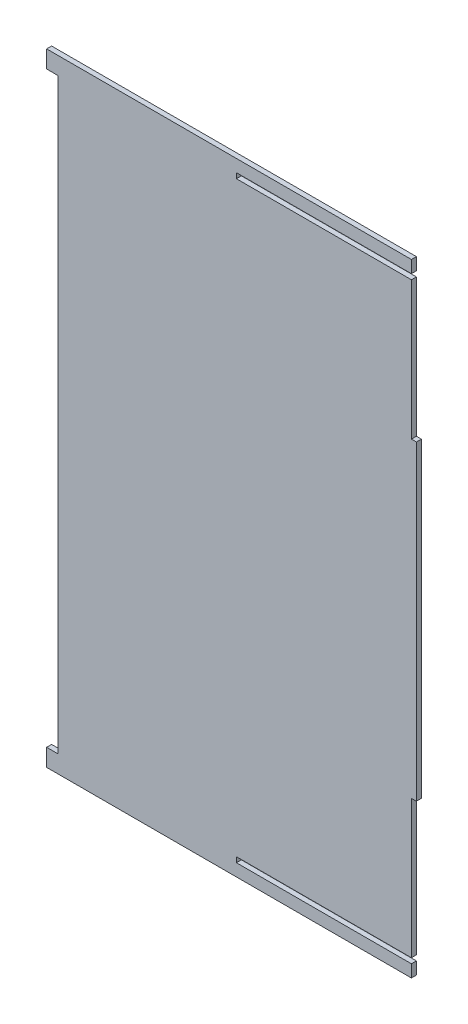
ISO-10303-21;
HEADER;
FILE_DESCRIPTION(('STEP AP214'),'2;1');
FILE_NAME('part.step','',(''),(''),'','','');
FILE_SCHEMA(('AUTOMOTIVE_DESIGN { 1 0 10303 214 1 1 1 1 }'));
ENDSEC;
DATA;
#1=APPLICATION_CONTEXT('core data for automotive mechanical design processes');
#2=APPLICATION_PROTOCOL_DEFINITION('international standard','automotive_design',2000,#1);
#3=PRODUCT_CONTEXT('',#1,'mechanical');
#4=PRODUCT('Part','Part','',(#3));
#5=PRODUCT_RELATED_PRODUCT_CATEGORY('part','',(#4));
#6=PRODUCT_DEFINITION_FORMATION('','',#4);
#7=PRODUCT_DEFINITION_CONTEXT('part definition',#1,'design');
#8=PRODUCT_DEFINITION('design','',#6,#7);
#9=PRODUCT_DEFINITION_SHAPE('','',#8);
#10=(LENGTH_UNIT() NAMED_UNIT(*) SI_UNIT(.MILLI.,.METRE.));
#11=(NAMED_UNIT(*) PLANE_ANGLE_UNIT() SI_UNIT($,.RADIAN.));
#12=(NAMED_UNIT(*) SI_UNIT($,.STERADIAN.) SOLID_ANGLE_UNIT());
#13=UNCERTAINTY_MEASURE_WITH_UNIT(LENGTH_MEASURE(1.E-05),#10,'distance_accuracy_value','');
#14=(GEOMETRIC_REPRESENTATION_CONTEXT(3) GLOBAL_UNCERTAINTY_ASSIGNED_CONTEXT((#13)) GLOBAL_UNIT_ASSIGNED_CONTEXT((#10,
#11,#12)) REPRESENTATION_CONTEXT('',''));
#15=CARTESIAN_POINT('',(0.,0.,0.));
#16=DIRECTION('',(0.,0.,1.));
#17=DIRECTION('',(1.,0.,0.));
#18=AXIS2_PLACEMENT_3D('',#15,#16,#17);
#19=CARTESIAN_POINT('',(-2252.6512,-320.2575,4.));
#20=DIRECTION('',(0.,1.,0.));
#21=DIRECTION('',(0.,0.,1.));
#22=AXIS2_PLACEMENT_3D('',#19,#20,#21);
#23=PLANE('',#22);
#24=DIRECTION('',(1.,0.,0.));
#25=VECTOR('',#24,1.);
#26=CARTESIAN_POINT('',(-2252.6512,-320.2575,0.));
#27=LINE('',#26,#25);
#28=CARTESIAN_POINT('',(-2252.6512,-320.2575,0.));
#29=VERTEX_POINT('',#28);
#30=CARTESIAN_POINT('',(-2112.0287,-320.2575,0.));
#31=VERTEX_POINT('',#30);
#32=EDGE_CURVE('E220',#29,#31,#27,.T.);
#33=ORIENTED_EDGE('',*,*,#32,.F.);
#34=DIRECTION('',(0.,0.,-1.));
#35=VECTOR('',#34,1.);
#36=CARTESIAN_POINT('',(-2252.6512,-320.2575,4.));
#37=LINE('',#36,#35);
#38=CARTESIAN_POINT('',(-2252.6512,-320.2575,4.));
#39=VERTEX_POINT('',#38);
#40=EDGE_CURVE('E11',#39,#29,#37,.T.);
#41=ORIENTED_EDGE('',*,*,#40,.F.);
#42=DIRECTION('',(1.,0.,0.));
#43=VECTOR('',#42,1.);
#44=CARTESIAN_POINT('',(-2252.6512,-320.2575,4.));
#45=LINE('',#44,#43);
#46=CARTESIAN_POINT('',(-2112.0287,-320.2575,4.));
#47=VERTEX_POINT('',#46);
#48=EDGE_CURVE('E294',#39,#47,#45,.T.);
#49=ORIENTED_EDGE('',*,*,#48,.T.);
#50=DIRECTION('',(0.,0.,-1.));
#51=VECTOR('',#50,1.);
#52=CARTESIAN_POINT('',(-2112.0287,-320.2575,4.));
#53=LINE('',#52,#51);
#54=EDGE_CURVE('E48',#47,#31,#53,.T.);
#55=ORIENTED_EDGE('',*,*,#54,.T.);
#56=EDGE_LOOP('',(#33,#41,#49,#55));
#57=FACE_BOUND('',#56,.T.);
#58=ADVANCED_FACE('F45',(#57),#23,.T.);
#59=CARTESIAN_POINT('',(-2252.6512,-320.1574,4.));
#60=DIRECTION('',(1.,0.,0.));
#61=DIRECTION('',(0.,0.,-1.));
#62=AXIS2_PLACEMENT_3D('',#59,#60,#61);
#63=PLANE('',#62);
#64=DIRECTION('',(0.,-1.,0.));
#65=VECTOR('',#64,1.);
#66=CARTESIAN_POINT('',(-2252.6512,-320.1574,0.));
#67=LINE('',#66,#65);
#68=CARTESIAN_POINT('',(-2252.6512,-316.0575,0.));
#69=VERTEX_POINT('',#68);
#70=EDGE_CURVE('E125',#69,#29,#67,.T.);
#71=ORIENTED_EDGE('',*,*,#70,.F.);
#72=DIRECTION('',(0.,0.,-1.));
#73=VECTOR('',#72,1.);
#74=CARTESIAN_POINT('',(-2252.6512,-316.0575,4.));
#75=LINE('',#74,#73);
#76=CARTESIAN_POINT('',(-2252.6512,-316.0575,4.));
#77=VERTEX_POINT('',#76);
#78=EDGE_CURVE('E55',#77,#69,#75,.T.);
#79=ORIENTED_EDGE('',*,*,#78,.F.);
#80=DIRECTION('',(0.,-1.,0.));
#81=VECTOR('',#80,1.);
#82=CARTESIAN_POINT('',(-2252.6512,-316.0575,4.));
#83=LINE('',#82,#81);
#84=EDGE_CURVE('E63',#77,#39,#83,.T.);
#85=ORIENTED_EDGE('',*,*,#84,.T.);
#86=ORIENTED_EDGE('',*,*,#40,.T.);
#87=EDGE_LOOP('',(#71,#79,#85,#86));
#88=FACE_BOUND('',#87,.T.);
#89=ADVANCED_FACE('F476',(#88),#63,.T.);
#90=CARTESIAN_POINT('',(-2112.0287,-316.0575,4.));
#91=DIRECTION('',(0.,-1.,0.));
#92=DIRECTION('',(0.,0.,-1.));
#93=AXIS2_PLACEMENT_3D('',#90,#91,#92);
#94=PLANE('',#93);
#95=DIRECTION('',(-1.,0.,0.));
#96=VECTOR('',#95,1.);
#97=CARTESIAN_POINT('',(-2112.0287,-316.0575,0.));
#98=LINE('',#97,#96);
#99=CARTESIAN_POINT('',(-2112.0287,-316.0575,0.));
#100=VERTEX_POINT('',#99);
#101=EDGE_CURVE('E192',#100,#69,#98,.T.);
#102=ORIENTED_EDGE('',*,*,#101,.F.);
#103=DIRECTION('',(0.,0.,-1.));
#104=VECTOR('',#103,1.);
#105=CARTESIAN_POINT('',(-2112.0287,-316.0575,4.));
#106=LINE('',#105,#104);
#107=CARTESIAN_POINT('',(-2112.0287,-316.0575,4.));
#108=VERTEX_POINT('',#107);
#109=EDGE_CURVE('E187',#108,#100,#106,.T.);
#110=ORIENTED_EDGE('',*,*,#109,.F.);
#111=DIRECTION('',(-1.,0.,0.));
#112=VECTOR('',#111,1.);
#113=CARTESIAN_POINT('',(-2112.0287,-316.0575,4.));
#114=LINE('',#113,#112);
#115=EDGE_CURVE('E190',#108,#77,#114,.T.);
#116=ORIENTED_EDGE('',*,*,#115,.T.);
#117=ORIENTED_EDGE('',*,*,#78,.T.);
#118=EDGE_LOOP('',(#102,#110,#116,#117));
#119=FACE_BOUND('',#118,.T.);
#120=ADVANCED_FACE('F189',(#119),#94,.T.);
#121=CARTESIAN_POINT('',(-2112.0287,-306.1574,4.));
#122=DIRECTION('',(1.,0.,0.));
#123=DIRECTION('',(0.,0.,-1.));
#124=AXIS2_PLACEMENT_3D('',#121,#122,#123);
#125=PLANE('',#124);
#126=DIRECTION('',(0.,-1.,0.));
#127=VECTOR('',#126,1.);
#128=CARTESIAN_POINT('',(-2112.0287,-306.1574,0.));
#129=LINE('',#128,#127);
#130=CARTESIAN_POINT('',(-2112.0287,-306.1574,0.));
#131=VERTEX_POINT('',#130);
#132=EDGE_CURVE('E288',#131,#100,#129,.T.);
#133=ORIENTED_EDGE('',*,*,#132,.F.);
#134=DIRECTION('',(0.,0.,-1.));
#135=VECTOR('',#134,1.);
#136=CARTESIAN_POINT('',(-2112.0287,-306.1574,4.));
#137=LINE('',#136,#135);
#138=CARTESIAN_POINT('',(-2112.0287,-306.1574,4.));
#139=VERTEX_POINT('',#138);
#140=EDGE_CURVE('E198',#139,#131,#137,.T.);
#141=ORIENTED_EDGE('',*,*,#140,.F.);
#142=DIRECTION('',(0.,-1.,0.));
#143=VECTOR('',#142,1.);
#144=CARTESIAN_POINT('',(-2112.0287,-306.1574,4.));
#145=LINE('',#144,#143);
#146=EDGE_CURVE('E205',#139,#108,#145,.T.);
#147=ORIENTED_EDGE('',*,*,#146,.T.);
#148=ORIENTED_EDGE('',*,*,#109,.T.);
#149=EDGE_LOOP('',(#133,#141,#147,#148));
#150=FACE_BOUND('',#149,.T.);
#151=ADVANCED_FACE('F209',(#150),#125,.T.);
#152=CARTESIAN_POINT('',(-2405.1329,-306.1574,4.));
#153=DIRECTION('',(0.,1.,0.));
#154=DIRECTION('',(0.,0.,1.));
#155=AXIS2_PLACEMENT_3D('',#152,#153,#154);
#156=PLANE('',#155);
#157=DIRECTION('',(1.,0.,0.));
#158=VECTOR('',#157,1.);
#159=CARTESIAN_POINT('',(-2405.1329,-306.1574,0.));
#160=LINE('',#159,#158);
#161=CARTESIAN_POINT('',(-2405.1329,-306.1574,0.));
#162=VERTEX_POINT('',#161);
#163=EDGE_CURVE('E284',#162,#131,#160,.T.);
#164=ORIENTED_EDGE('',*,*,#163,.F.);
#165=DIRECTION('',(0.,0.,-1.));
#166=VECTOR('',#165,1.);
#167=CARTESIAN_POINT('',(-2405.1329,-306.1574,4.));
#168=LINE('',#167,#166);
#169=CARTESIAN_POINT('',(-2405.1329,-306.1574,4.));
#170=VERTEX_POINT('',#169);
#171=EDGE_CURVE('E300',#170,#162,#168,.T.);
#172=ORIENTED_EDGE('',*,*,#171,.F.);
#173=DIRECTION('',(1.,0.,0.));
#174=VECTOR('',#173,1.);
#175=CARTESIAN_POINT('',(-2405.1329,-306.1574,4.));
#176=LINE('',#175,#174);
#177=EDGE_CURVE('E211',#170,#139,#176,.T.);
#178=ORIENTED_EDGE('',*,*,#177,.T.);
#179=ORIENTED_EDGE('',*,*,#140,.T.);
#180=EDGE_LOOP('',(#164,#172,#178,#179));
#181=FACE_BOUND('',#180,.T.);
#182=ADVANCED_FACE('F354',(#181),#156,.T.);
#183=CARTESIAN_POINT('',(-2405.1329,-320.1574,4.));
#184=DIRECTION('',(-1.,0.,0.));
#185=DIRECTION('',(0.,0.,1.));
#186=AXIS2_PLACEMENT_3D('',#183,#184,#185);
#187=PLANE('',#186);
#188=DIRECTION('',(0.,1.,0.));
#189=VECTOR('',#188,1.);
#190=CARTESIAN_POINT('',(-2405.1329,-320.1574,0.));
#191=LINE('',#190,#189);
#192=CARTESIAN_POINT('',(-2405.1329,-320.1574,0.));
#193=VERTEX_POINT('',#192);
#194=EDGE_CURVE('E280',#193,#162,#191,.T.);
#195=ORIENTED_EDGE('',*,*,#194,.F.);
#196=DIRECTION('',(0.,0.,-1.));
#197=VECTOR('',#196,1.);
#198=CARTESIAN_POINT('',(-2405.1329,-320.1574,4.));
#199=LINE('',#198,#197);
#200=CARTESIAN_POINT('',(-2405.1329,-320.1574,4.));
#201=VERTEX_POINT('',#200);
#202=EDGE_CURVE('E303',#201,#193,#199,.T.);
#203=ORIENTED_EDGE('',*,*,#202,.F.);
#204=DIRECTION('',(0.,1.,0.));
#205=VECTOR('',#204,1.);
#206=CARTESIAN_POINT('',(-2405.1329,-320.1574,4.));
#207=LINE('',#206,#205);
#208=EDGE_CURVE('E214',#201,#170,#207,.T.);
#209=ORIENTED_EDGE('',*,*,#208,.T.);
#210=ORIENTED_EDGE('',*,*,#171,.T.);
#211=EDGE_LOOP('',(#195,#203,#209,#210));
#212=FACE_BOUND('',#211,.T.);
#213=ADVANCED_FACE('F360',(#212),#187,.T.);
#214=CARTESIAN_POINT('',(-2396.0286,-320.1574,4.));
#215=DIRECTION('',(0.,-1.,0.));
#216=DIRECTION('',(0.,0.,-1.));
#217=AXIS2_PLACEMENT_3D('',#214,#215,#216);
#218=PLANE('',#217);
#219=DIRECTION('',(-1.,0.,0.));
#220=VECTOR('',#219,1.);
#221=CARTESIAN_POINT('',(-2396.0286,-320.1574,0.));
#222=LINE('',#221,#220);
#223=CARTESIAN_POINT('',(-2396.0286,-320.1574,0.));
#224=VERTEX_POINT('',#223);
#225=EDGE_CURVE('E276',#224,#193,#222,.T.);
#226=ORIENTED_EDGE('',*,*,#225,.F.);
#227=DIRECTION('',(0.,0.,-1.));
#228=VECTOR('',#227,1.);
#229=CARTESIAN_POINT('',(-2396.0286,-320.1574,4.));
#230=LINE('',#229,#228);
#231=CARTESIAN_POINT('',(-2396.0286,-320.1574,4.));
#232=VERTEX_POINT('',#231);
#233=EDGE_CURVE('E306',#232,#224,#230,.T.);
#234=ORIENTED_EDGE('',*,*,#233,.F.);
#235=DIRECTION('',(-1.,0.,0.));
#236=VECTOR('',#235,1.);
#237=CARTESIAN_POINT('',(-2396.0286,-320.1574,4.));
#238=LINE('',#237,#236);
#239=EDGE_CURVE('E362',#232,#201,#238,.T.);
#240=ORIENTED_EDGE('',*,*,#239,.T.);
#241=ORIENTED_EDGE('',*,*,#202,.T.);
#242=EDGE_LOOP('',(#226,#234,#240,#241));
#243=FACE_BOUND('',#242,.T.);
#244=ADVANCED_FACE('F466',(#243),#218,.T.);
#245=CARTESIAN_POINT('',(-2396.0286,-792.1574,4.));
#246=DIRECTION('',(-1.,0.,0.));
#247=DIRECTION('',(0.,0.,1.));
#248=AXIS2_PLACEMENT_3D('',#245,#246,#247);
#249=PLANE('',#248);
#250=DIRECTION('',(0.,1.,0.));
#251=VECTOR('',#250,1.);
#252=CARTESIAN_POINT('',(-2396.0286,-792.1574,0.));
#253=LINE('',#252,#251);
#254=CARTESIAN_POINT('',(-2396.0286,-792.1574,0.));
#255=VERTEX_POINT('',#254);
#256=EDGE_CURVE('E272',#255,#224,#253,.T.);
#257=ORIENTED_EDGE('',*,*,#256,.F.);
#258=DIRECTION('',(0.,0.,-1.));
#259=VECTOR('',#258,1.);
#260=CARTESIAN_POINT('',(-2396.0286,-792.1574,4.));
#261=LINE('',#260,#259);
#262=CARTESIAN_POINT('',(-2396.0286,-792.1574,4.));
#263=VERTEX_POINT('',#262);
#264=EDGE_CURVE('E309',#263,#255,#261,.T.);
#265=ORIENTED_EDGE('',*,*,#264,.F.);
#266=DIRECTION('',(0.,1.,0.));
#267=VECTOR('',#266,1.);
#268=CARTESIAN_POINT('',(-2396.0286,-792.1574,4.));
#269=LINE('',#268,#267);
#270=EDGE_CURVE('E364',#263,#232,#269,.T.);
#271=ORIENTED_EDGE('',*,*,#270,.T.);
#272=ORIENTED_EDGE('',*,*,#233,.T.);
#273=EDGE_LOOP('',(#257,#265,#271,#272));
#274=FACE_BOUND('',#273,.T.);
#275=ADVANCED_FACE('F463',(#274),#249,.T.);
#276=CARTESIAN_POINT('',(-2405.1329,-792.1574,4.));
#277=DIRECTION('',(0.,1.,0.));
#278=DIRECTION('',(0.,0.,1.));
#279=AXIS2_PLACEMENT_3D('',#276,#277,#278);
#280=PLANE('',#279);
#281=DIRECTION('',(1.,0.,0.));
#282=VECTOR('',#281,1.);
#283=CARTESIAN_POINT('',(-2405.1329,-792.1574,0.));
#284=LINE('',#283,#282);
#285=CARTESIAN_POINT('',(-2405.1329,-792.1574,0.));
#286=VERTEX_POINT('',#285);
#287=EDGE_CURVE('E268',#286,#255,#284,.T.);
#288=ORIENTED_EDGE('',*,*,#287,.F.);
#289=DIRECTION('',(0.,0.,-1.));
#290=VECTOR('',#289,1.);
#291=CARTESIAN_POINT('',(-2405.1329,-792.1574,4.));
#292=LINE('',#291,#290);
#293=CARTESIAN_POINT('',(-2405.1329,-792.1574,4.));
#294=VERTEX_POINT('',#293);
#295=EDGE_CURVE('E312',#294,#286,#292,.T.);
#296=ORIENTED_EDGE('',*,*,#295,.F.);
#297=DIRECTION('',(1.,0.,0.));
#298=VECTOR('',#297,1.);
#299=CARTESIAN_POINT('',(-2405.1329,-792.1574,4.));
#300=LINE('',#299,#298);
#301=EDGE_CURVE('E370',#294,#263,#300,.T.);
#302=ORIENTED_EDGE('',*,*,#301,.T.);
#303=ORIENTED_EDGE('',*,*,#264,.T.);
#304=EDGE_LOOP('',(#288,#296,#302,#303));
#305=FACE_BOUND('',#304,.T.);
#306=ADVANCED_FACE('F459',(#305),#280,.T.);
#307=CARTESIAN_POINT('',(-2405.1329,-806.1574,4.));
#308=DIRECTION('',(-1.,0.,0.));
#309=DIRECTION('',(0.,0.,1.));
#310=AXIS2_PLACEMENT_3D('',#307,#308,#309);
#311=PLANE('',#310);
#312=DIRECTION('',(0.,1.,0.));
#313=VECTOR('',#312,1.);
#314=CARTESIAN_POINT('',(-2405.1329,-806.1574,0.));
#315=LINE('',#314,#313);
#316=CARTESIAN_POINT('',(-2405.1329,-806.1574,0.));
#317=VERTEX_POINT('',#316);
#318=EDGE_CURVE('E264',#317,#286,#315,.T.);
#319=ORIENTED_EDGE('',*,*,#318,.F.);
#320=DIRECTION('',(0.,0.,-1.));
#321=VECTOR('',#320,1.);
#322=CARTESIAN_POINT('',(-2405.1329,-806.1574,4.));
#323=LINE('',#322,#321);
#324=CARTESIAN_POINT('',(-2405.1329,-806.1574,4.));
#325=VERTEX_POINT('',#324);
#326=EDGE_CURVE('E315',#325,#317,#323,.T.);
#327=ORIENTED_EDGE('',*,*,#326,.F.);
#328=DIRECTION('',(0.,1.,0.));
#329=VECTOR('',#328,1.);
#330=CARTESIAN_POINT('',(-2405.1329,-806.1574,4.));
#331=LINE('',#330,#329);
#332=EDGE_CURVE('E374',#325,#294,#331,.T.);
#333=ORIENTED_EDGE('',*,*,#332,.T.);
#334=ORIENTED_EDGE('',*,*,#295,.T.);
#335=EDGE_LOOP('',(#319,#327,#333,#334));
#336=FACE_BOUND('',#335,.T.);
#337=ADVANCED_FACE('F455',(#336),#311,.T.);
#338=CARTESIAN_POINT('',(-2112.0287,-806.1574,4.));
#339=DIRECTION('',(0.,-1.,0.));
#340=DIRECTION('',(0.,0.,-1.));
#341=AXIS2_PLACEMENT_3D('',#338,#339,#340);
#342=PLANE('',#341);
#343=DIRECTION('',(-1.,0.,0.));
#344=VECTOR('',#343,1.);
#345=CARTESIAN_POINT('',(-2112.0287,-806.1574,0.));
#346=LINE('',#345,#344);
#347=CARTESIAN_POINT('',(-2112.0287,-806.1574,0.));
#348=VERTEX_POINT('',#347);
#349=EDGE_CURVE('E260',#348,#317,#346,.T.);
#350=ORIENTED_EDGE('',*,*,#349,.F.);
#351=DIRECTION('',(0.,0.,-1.));
#352=VECTOR('',#351,1.);
#353=CARTESIAN_POINT('',(-2112.0287,-806.1574,4.));
#354=LINE('',#353,#352);
#355=CARTESIAN_POINT('',(-2112.0287,-806.1574,4.));
#356=VERTEX_POINT('',#355);
#357=EDGE_CURVE('E318',#356,#348,#354,.T.);
#358=ORIENTED_EDGE('',*,*,#357,.F.);
#359=DIRECTION('',(-1.,0.,0.));
#360=VECTOR('',#359,1.);
#361=CARTESIAN_POINT('',(-2112.0287,-806.1574,4.));
#362=LINE('',#361,#360);
#363=EDGE_CURVE('E378',#356,#325,#362,.T.);
#364=ORIENTED_EDGE('',*,*,#363,.T.);
#365=ORIENTED_EDGE('',*,*,#326,.T.);
#366=EDGE_LOOP('',(#350,#358,#364,#365));
#367=FACE_BOUND('',#366,.T.);
#368=ADVANCED_FACE('F451',(#367),#342,.T.);
#369=CARTESIAN_POINT('',(-2112.0287,-796.2574,4.));
#370=DIRECTION('',(1.,0.,0.));
#371=DIRECTION('',(0.,0.,-1.));
#372=AXIS2_PLACEMENT_3D('',#369,#370,#371);
#373=PLANE('',#372);
#374=DIRECTION('',(0.,-1.,0.));
#375=VECTOR('',#374,1.);
#376=CARTESIAN_POINT('',(-2112.0287,-796.2574,0.));
#377=LINE('',#376,#375);
#378=CARTESIAN_POINT('',(-2112.0287,-796.2574,0.));
#379=VERTEX_POINT('',#378);
#380=EDGE_CURVE('E256',#379,#348,#377,.T.);
#381=ORIENTED_EDGE('',*,*,#380,.F.);
#382=DIRECTION('',(0.,0.,-1.));
#383=VECTOR('',#382,1.);
#384=CARTESIAN_POINT('',(-2112.0287,-796.2574,4.));
#385=LINE('',#384,#383);
#386=CARTESIAN_POINT('',(-2112.0287,-796.2574,4.));
#387=VERTEX_POINT('',#386);
#388=EDGE_CURVE('E321',#387,#379,#385,.T.);
#389=ORIENTED_EDGE('',*,*,#388,.F.);
#390=DIRECTION('',(0.,-1.,0.));
#391=VECTOR('',#390,1.);
#392=CARTESIAN_POINT('',(-2112.0287,-796.2574,4.));
#393=LINE('',#392,#391);
#394=EDGE_CURVE('E382',#387,#356,#393,.T.);
#395=ORIENTED_EDGE('',*,*,#394,.T.);
#396=ORIENTED_EDGE('',*,*,#357,.T.);
#397=EDGE_LOOP('',(#381,#389,#395,#396));
#398=FACE_BOUND('',#397,.T.);
#399=ADVANCED_FACE('F449',(#398),#373,.T.);
#400=CARTESIAN_POINT('',(-2252.6512,-796.2574,4.));
#401=DIRECTION('',(0.,1.,0.));
#402=DIRECTION('',(0.,0.,1.));
#403=AXIS2_PLACEMENT_3D('',#400,#401,#402);
#404=PLANE('',#403);
#405=DIRECTION('',(1.,0.,0.));
#406=VECTOR('',#405,1.);
#407=CARTESIAN_POINT('',(-2252.6512,-796.2574,0.));
#408=LINE('',#407,#406);
#409=CARTESIAN_POINT('',(-2252.6512,-796.2574,0.));
#410=VERTEX_POINT('',#409);
#411=EDGE_CURVE('E252',#410,#379,#408,.T.);
#412=ORIENTED_EDGE('',*,*,#411,.F.);
#413=DIRECTION('',(0.,0.,-1.));
#414=VECTOR('',#413,1.);
#415=CARTESIAN_POINT('',(-2252.6512,-796.2574,4.));
#416=LINE('',#415,#414);
#417=CARTESIAN_POINT('',(-2252.6512,-796.2574,4.));
#418=VERTEX_POINT('',#417);
#419=EDGE_CURVE('E324',#418,#410,#416,.T.);
#420=ORIENTED_EDGE('',*,*,#419,.F.);
#421=DIRECTION('',(1.,0.,0.));
#422=VECTOR('',#421,1.);
#423=CARTESIAN_POINT('',(-2252.6512,-796.2574,4.));
#424=LINE('',#423,#422);
#425=EDGE_CURVE('E386',#418,#387,#424,.T.);
#426=ORIENTED_EDGE('',*,*,#425,.T.);
#427=ORIENTED_EDGE('',*,*,#388,.T.);
#428=EDGE_LOOP('',(#412,#420,#426,#427));
#429=FACE_BOUND('',#428,.T.);
#430=ADVANCED_FACE('F445',(#429),#404,.T.);
#431=CARTESIAN_POINT('',(-2252.6512,-796.1574,4.));
#432=DIRECTION('',(1.,0.,0.));
#433=DIRECTION('',(0.,0.,-1.));
#434=AXIS2_PLACEMENT_3D('',#431,#432,#433);
#435=PLANE('',#434);
#436=DIRECTION('',(0.,-1.,0.));
#437=VECTOR('',#436,1.);
#438=CARTESIAN_POINT('',(-2252.6512,-796.1574,0.));
#439=LINE('',#438,#437);
#440=CARTESIAN_POINT('',(-2252.6512,-792.0574,0.));
#441=VERTEX_POINT('',#440);
#442=EDGE_CURVE('E248',#441,#410,#439,.T.);
#443=ORIENTED_EDGE('',*,*,#442,.F.);
#444=DIRECTION('',(0.,0.,-1.));
#445=VECTOR('',#444,1.);
#446=CARTESIAN_POINT('',(-2252.6512,-792.0574,4.));
#447=LINE('',#446,#445);
#448=CARTESIAN_POINT('',(-2252.6512,-792.0574,4.));
#449=VERTEX_POINT('',#448);
#450=EDGE_CURVE('E327',#449,#441,#447,.T.);
#451=ORIENTED_EDGE('',*,*,#450,.F.);
#452=DIRECTION('',(0.,-1.,0.));
#453=VECTOR('',#452,1.);
#454=CARTESIAN_POINT('',(-2252.6512,-792.0574,4.));
#455=LINE('',#454,#453);
#456=EDGE_CURVE('E390',#449,#418,#455,.T.);
#457=ORIENTED_EDGE('',*,*,#456,.T.);
#458=ORIENTED_EDGE('',*,*,#419,.T.);
#459=EDGE_LOOP('',(#443,#451,#457,#458));
#460=FACE_BOUND('',#459,.T.);
#461=ADVANCED_FACE('F438',(#460),#435,.T.);
#462=CARTESIAN_POINT('',(-2112.0287,-792.0574,4.));
#463=DIRECTION('',(0.,-1.,0.));
#464=DIRECTION('',(0.,0.,-1.));
#465=AXIS2_PLACEMENT_3D('',#462,#463,#464);
#466=PLANE('',#465);
#467=DIRECTION('',(-1.,0.,0.));
#468=VECTOR('',#467,1.);
#469=CARTESIAN_POINT('',(-2112.0287,-792.0574,0.));
#470=LINE('',#469,#468);
#471=CARTESIAN_POINT('',(-2112.0287,-792.0574,0.));
#472=VERTEX_POINT('',#471);
#473=EDGE_CURVE('E244',#472,#441,#470,.T.);
#474=ORIENTED_EDGE('',*,*,#473,.F.);
#475=DIRECTION('',(0.,0.,-1.));
#476=VECTOR('',#475,1.);
#477=CARTESIAN_POINT('',(-2112.0287,-792.0574,4.));
#478=LINE('',#477,#476);
#479=CARTESIAN_POINT('',(-2112.0287,-792.0574,4.));
#480=VERTEX_POINT('',#479);
#481=EDGE_CURVE('E331',#480,#472,#478,.T.);
#482=ORIENTED_EDGE('',*,*,#481,.F.);
#483=DIRECTION('',(-1.,0.,0.));
#484=VECTOR('',#483,1.);
#485=CARTESIAN_POINT('',(-2112.0287,-792.0574,4.));
#486=LINE('',#485,#484);
#487=EDGE_CURVE('E393',#480,#449,#486,.T.);
#488=ORIENTED_EDGE('',*,*,#487,.T.);
#489=ORIENTED_EDGE('',*,*,#450,.T.);
#490=EDGE_LOOP('',(#474,#482,#488,#489));
#491=FACE_BOUND('',#490,.T.);
#492=ADVANCED_FACE('F434',(#491),#466,.T.);
#493=CARTESIAN_POINT('',(-2112.0287,-681.1574,4.));
#494=DIRECTION('',(1.,0.,0.));
#495=DIRECTION('',(0.,0.,-1.));
#496=AXIS2_PLACEMENT_3D('',#493,#494,#495);
#497=PLANE('',#496);
#498=DIRECTION('',(0.,-1.,0.));
#499=VECTOR('',#498,1.);
#500=CARTESIAN_POINT('',(-2112.0287,-681.1574,0.));
#501=LINE('',#500,#499);
#502=CARTESIAN_POINT('',(-2112.0287,-681.1574,0.));
#503=VERTEX_POINT('',#502);
#504=EDGE_CURVE('E240',#503,#472,#501,.T.);
#505=ORIENTED_EDGE('',*,*,#504,.F.);
#506=DIRECTION('',(0.,0.,-1.));
#507=VECTOR('',#506,1.);
#508=CARTESIAN_POINT('',(-2112.0287,-681.1574,4.));
#509=LINE('',#508,#507);
#510=CARTESIAN_POINT('',(-2112.0287,-681.1574,4.));
#511=VERTEX_POINT('',#510);
#512=EDGE_CURVE('E334',#511,#503,#509,.T.);
#513=ORIENTED_EDGE('',*,*,#512,.F.);
#514=DIRECTION('',(0.,-1.,0.));
#515=VECTOR('',#514,1.);
#516=CARTESIAN_POINT('',(-2112.0287,-681.1574,4.));
#517=LINE('',#516,#515);
#518=EDGE_CURVE('E397',#511,#480,#517,.T.);
#519=ORIENTED_EDGE('',*,*,#518,.T.);
#520=ORIENTED_EDGE('',*,*,#481,.T.);
#521=EDGE_LOOP('',(#505,#513,#519,#520));
#522=FACE_BOUND('',#521,.T.);
#523=ADVANCED_FACE('F431',(#522),#497,.T.);
#524=CARTESIAN_POINT('',(-2108.0287,-681.1574,4.));
#525=DIRECTION('',(0.,-1.,0.));
#526=DIRECTION('',(0.,0.,-1.));
#527=AXIS2_PLACEMENT_3D('',#524,#525,#526);
#528=PLANE('',#527);
#529=DIRECTION('',(-1.,0.,0.));
#530=VECTOR('',#529,1.);
#531=CARTESIAN_POINT('',(-2108.0287,-681.1574,0.));
#532=LINE('',#531,#530);
#533=CARTESIAN_POINT('',(-2108.0287,-681.1574,0.));
#534=VERTEX_POINT('',#533);
#535=EDGE_CURVE('E236',#534,#503,#532,.T.);
#536=ORIENTED_EDGE('',*,*,#535,.F.);
#537=DIRECTION('',(0.,0.,-1.));
#538=VECTOR('',#537,1.);
#539=CARTESIAN_POINT('',(-2108.0287,-681.1574,4.));
#540=LINE('',#539,#538);
#541=CARTESIAN_POINT('',(-2108.0287,-681.1574,4.));
#542=VERTEX_POINT('',#541);
#543=EDGE_CURVE('E337',#542,#534,#540,.T.);
#544=ORIENTED_EDGE('',*,*,#543,.F.);
#545=DIRECTION('',(-1.,0.,0.));
#546=VECTOR('',#545,1.);
#547=CARTESIAN_POINT('',(-2108.0287,-681.1574,4.));
#548=LINE('',#547,#546);
#549=EDGE_CURVE('E401',#542,#511,#548,.T.);
#550=ORIENTED_EDGE('',*,*,#549,.T.);
#551=ORIENTED_EDGE('',*,*,#512,.T.);
#552=EDGE_LOOP('',(#536,#544,#550,#551));
#553=FACE_BOUND('',#552,.T.);
#554=ADVANCED_FACE('F427',(#553),#528,.T.);
#555=CARTESIAN_POINT('',(-2108.0287,-431.1574,4.));
#556=DIRECTION('',(1.,0.,0.));
#557=DIRECTION('',(0.,0.,-1.));
#558=AXIS2_PLACEMENT_3D('',#555,#556,#557);
#559=PLANE('',#558);
#560=DIRECTION('',(0.,-1.,0.));
#561=VECTOR('',#560,1.);
#562=CARTESIAN_POINT('',(-2108.0287,-431.1574,0.));
#563=LINE('',#562,#561);
#564=CARTESIAN_POINT('',(-2108.0287,-431.1574,0.));
#565=VERTEX_POINT('',#564);
#566=EDGE_CURVE('E232',#565,#534,#563,.T.);
#567=ORIENTED_EDGE('',*,*,#566,.F.);
#568=DIRECTION('',(0.,0.,-1.));
#569=VECTOR('',#568,1.);
#570=CARTESIAN_POINT('',(-2108.0287,-431.1574,4.));
#571=LINE('',#570,#569);
#572=CARTESIAN_POINT('',(-2108.0287,-431.1574,4.));
#573=VERTEX_POINT('',#572);
#574=EDGE_CURVE('E340',#573,#565,#571,.T.);
#575=ORIENTED_EDGE('',*,*,#574,.F.);
#576=DIRECTION('',(0.,-1.,0.));
#577=VECTOR('',#576,1.);
#578=CARTESIAN_POINT('',(-2108.0287,-431.1574,4.));
#579=LINE('',#578,#577);
#580=EDGE_CURVE('E405',#573,#542,#579,.T.);
#581=ORIENTED_EDGE('',*,*,#580,.T.);
#582=ORIENTED_EDGE('',*,*,#543,.T.);
#583=EDGE_LOOP('',(#567,#575,#581,#582));
#584=FACE_BOUND('',#583,.T.);
#585=ADVANCED_FACE('F425',(#584),#559,.T.);
#586=CARTESIAN_POINT('',(-2112.0287,-431.1574,4.));
#587=DIRECTION('',(0.,1.,0.));
#588=DIRECTION('',(0.,0.,1.));
#589=AXIS2_PLACEMENT_3D('',#586,#587,#588);
#590=PLANE('',#589);
#591=DIRECTION('',(1.,0.,0.));
#592=VECTOR('',#591,1.);
#593=CARTESIAN_POINT('',(-2112.0287,-431.1574,0.));
#594=LINE('',#593,#592);
#595=CARTESIAN_POINT('',(-2112.0287,-431.1574,0.));
#596=VERTEX_POINT('',#595);
#597=EDGE_CURVE('E228',#596,#565,#594,.T.);
#598=ORIENTED_EDGE('',*,*,#597,.F.);
#599=DIRECTION('',(0.,0.,-1.));
#600=VECTOR('',#599,1.);
#601=CARTESIAN_POINT('',(-2112.0287,-431.1574,4.));
#602=LINE('',#601,#600);
#603=CARTESIAN_POINT('',(-2112.0287,-431.1574,4.));
#604=VERTEX_POINT('',#603);
#605=EDGE_CURVE('E342',#604,#596,#602,.T.);
#606=ORIENTED_EDGE('',*,*,#605,.F.);
#607=DIRECTION('',(1.,0.,0.));
#608=VECTOR('',#607,1.);
#609=CARTESIAN_POINT('',(-2112.0287,-431.1574,4.));
#610=LINE('',#609,#608);
#611=EDGE_CURVE('E409',#604,#573,#610,.T.);
#612=ORIENTED_EDGE('',*,*,#611,.T.);
#613=ORIENTED_EDGE('',*,*,#574,.T.);
#614=EDGE_LOOP('',(#598,#606,#612,#613));
#615=FACE_BOUND('',#614,.T.);
#616=ADVANCED_FACE('F421',(#615),#590,.T.);
#617=CARTESIAN_POINT('',(-2112.0287,-320.2575,4.));
#618=DIRECTION('',(1.,0.,0.));
#619=DIRECTION('',(0.,0.,-1.));
#620=AXIS2_PLACEMENT_3D('',#617,#618,#619);
#621=PLANE('',#620);
#622=DIRECTION('',(0.,-1.,0.));
#623=VECTOR('',#622,1.);
#624=CARTESIAN_POINT('',(-2112.0287,-320.2575,0.));
#625=LINE('',#624,#623);
#626=EDGE_CURVE('E224',#31,#596,#625,.T.);
#627=ORIENTED_EDGE('',*,*,#626,.F.);
#628=ORIENTED_EDGE('',*,*,#54,.F.);
#629=DIRECTION('',(0.,-1.,0.));
#630=VECTOR('',#629,1.);
#631=CARTESIAN_POINT('',(-2112.0287,-320.2575,4.));
#632=LINE('',#631,#630);
#633=EDGE_CURVE('E413',#47,#604,#632,.T.);
#634=ORIENTED_EDGE('',*,*,#633,.T.);
#635=ORIENTED_EDGE('',*,*,#605,.T.);
#636=EDGE_LOOP('',(#627,#628,#634,#635));
#637=FACE_BOUND('',#636,.T.);
#638=ADVANCED_FACE('F348',(#637),#621,.T.);
#639=CARTESIAN_POINT('',(0.,0.,4.));
#640=DIRECTION('',(0.,0.,-1.));
#641=DIRECTION('',(-1.,0.,0.));
#642=AXIS2_PLACEMENT_3D('',#639,#640,#641);
#643=PLANE('',#642);
#644=ORIENTED_EDGE('',*,*,#48,.F.);
#645=ORIENTED_EDGE('',*,*,#84,.F.);
#646=ORIENTED_EDGE('',*,*,#115,.F.);
#647=ORIENTED_EDGE('',*,*,#146,.F.);
#648=ORIENTED_EDGE('',*,*,#177,.F.);
#649=ORIENTED_EDGE('',*,*,#208,.F.);
#650=ORIENTED_EDGE('',*,*,#239,.F.);
#651=ORIENTED_EDGE('',*,*,#270,.F.);
#652=ORIENTED_EDGE('',*,*,#301,.F.);
#653=ORIENTED_EDGE('',*,*,#332,.F.);
#654=ORIENTED_EDGE('',*,*,#363,.F.);
#655=ORIENTED_EDGE('',*,*,#394,.F.);
#656=ORIENTED_EDGE('',*,*,#425,.F.);
#657=ORIENTED_EDGE('',*,*,#456,.F.);
#658=ORIENTED_EDGE('',*,*,#487,.F.);
#659=ORIENTED_EDGE('',*,*,#518,.F.);
#660=ORIENTED_EDGE('',*,*,#549,.F.);
#661=ORIENTED_EDGE('',*,*,#580,.F.);
#662=ORIENTED_EDGE('',*,*,#611,.F.);
#663=ORIENTED_EDGE('',*,*,#633,.F.);
#664=EDGE_LOOP('',(#644,#645,#646,#647,#648,#649,#650,#651,#652,#653,#654,#655,#656,#657,#658,
#659,#660,#661,#662,#663));
#665=FACE_BOUND('',#664,.T.);
#666=ADVANCED_FACE('F203',(#665),#643,.F.);
#667=CARTESIAN_POINT('',(0.,0.,0.));
#668=DIRECTION('',(0.,0.,-1.));
#669=DIRECTION('',(-1.,0.,0.));
#670=AXIS2_PLACEMENT_3D('',#667,#668,#669);
#671=PLANE('',#670);
#672=ORIENTED_EDGE('',*,*,#32,.T.);
#673=ORIENTED_EDGE('',*,*,#626,.T.);
#674=ORIENTED_EDGE('',*,*,#597,.T.);
#675=ORIENTED_EDGE('',*,*,#566,.T.);
#676=ORIENTED_EDGE('',*,*,#535,.T.);
#677=ORIENTED_EDGE('',*,*,#504,.T.);
#678=ORIENTED_EDGE('',*,*,#473,.T.);
#679=ORIENTED_EDGE('',*,*,#442,.T.);
#680=ORIENTED_EDGE('',*,*,#411,.T.);
#681=ORIENTED_EDGE('',*,*,#380,.T.);
#682=ORIENTED_EDGE('',*,*,#349,.T.);
#683=ORIENTED_EDGE('',*,*,#318,.T.);
#684=ORIENTED_EDGE('',*,*,#287,.T.);
#685=ORIENTED_EDGE('',*,*,#256,.T.);
#686=ORIENTED_EDGE('',*,*,#225,.T.);
#687=ORIENTED_EDGE('',*,*,#194,.T.);
#688=ORIENTED_EDGE('',*,*,#163,.T.);
#689=ORIENTED_EDGE('',*,*,#132,.T.);
#690=ORIENTED_EDGE('',*,*,#101,.T.);
#691=ORIENTED_EDGE('',*,*,#70,.T.);
#692=EDGE_LOOP('',(#672,#673,#674,#675,#676,#677,#678,#679,#680,#681,#682,#683,#684,#685,#686,
#687,#688,#689,#690,#691));
#693=FACE_BOUND('',#692,.T.);
#694=ADVANCED_FACE('F350',(#693),#671,.T.);
#695=CLOSED_SHELL('',(#58,#89,#120,#151,#182,#213,#244,#275,#306,#337,#368,#399,#430,#461,#492,
#523,#554,#585,#616,#638,#666,#694));
#696=MANIFOLD_SOLID_BREP('B2',#695);
#697=ADVANCED_BREP_SHAPE_REPRESENTATION('',(#18,#696),#14);
#698=SHAPE_DEFINITION_REPRESENTATION(#9,#697);
ENDSEC;
END-ISO-10303-21;
